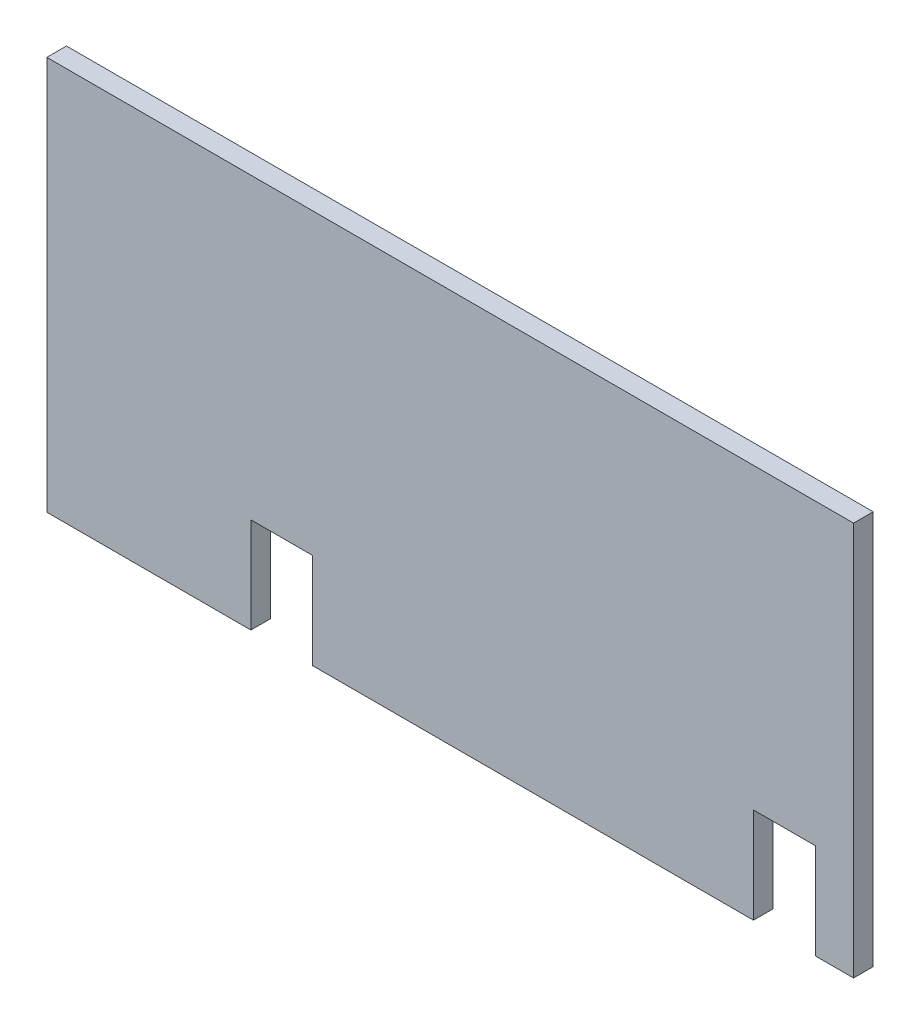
ISO-10303-21;
HEADER;
FILE_DESCRIPTION(('STEP AP214'),'2;1');
FILE_NAME('part.step','',(''),(''),'','','');
FILE_SCHEMA(('AUTOMOTIVE_DESIGN { 1 0 10303 214 1 1 1 1 }'));
ENDSEC;
DATA;
#1=APPLICATION_CONTEXT('core data for automotive mechanical design processes');
#2=APPLICATION_PROTOCOL_DEFINITION('international standard','automotive_design',2000,#1);
#3=PRODUCT_CONTEXT('',#1,'mechanical');
#4=PRODUCT('Part','Part','',(#3));
#5=PRODUCT_RELATED_PRODUCT_CATEGORY('part','',(#4));
#6=PRODUCT_DEFINITION_FORMATION('','',#4);
#7=PRODUCT_DEFINITION_CONTEXT('part definition',#1,'design');
#8=PRODUCT_DEFINITION('design','',#6,#7);
#9=PRODUCT_DEFINITION_SHAPE('','',#8);
#10=(LENGTH_UNIT() NAMED_UNIT(*) SI_UNIT(.MILLI.,.METRE.));
#11=(NAMED_UNIT(*) PLANE_ANGLE_UNIT() SI_UNIT($,.RADIAN.));
#12=(NAMED_UNIT(*) SI_UNIT($,.STERADIAN.) SOLID_ANGLE_UNIT());
#13=UNCERTAINTY_MEASURE_WITH_UNIT(LENGTH_MEASURE(1.E-05),#10,'distance_accuracy_value','');
#14=(GEOMETRIC_REPRESENTATION_CONTEXT(3) GLOBAL_UNCERTAINTY_ASSIGNED_CONTEXT((#13)) GLOBAL_UNIT_ASSIGNED_CONTEXT((#10,
#11,#12)) REPRESENTATION_CONTEXT('',''));
#15=CARTESIAN_POINT('',(0.,0.,0.));
#16=DIRECTION('',(0.,0.,1.));
#17=DIRECTION('',(1.,0.,0.));
#18=AXIS2_PLACEMENT_3D('',#15,#16,#17);
#19=CARTESIAN_POINT('',(-120.396,-17.4250000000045,2.54));
#20=DIRECTION('',(1.,0.,0.));
#21=DIRECTION('',(0.,0.,-1.));
#22=AXIS2_PLACEMENT_3D('',#19,#20,#21);
#23=PLANE('',#22);
#24=DIRECTION('',(0.,-1.,0.));
#25=VECTOR('',#24,1.);
#26=CARTESIAN_POINT('',(-120.396,-17.4250000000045,0.));
#27=LINE('',#26,#25);
#28=CARTESIAN_POINT('',(-120.396,33.5279999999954,0.));
#29=VERTEX_POINT('',#28);
#30=CARTESIAN_POINT('',(-120.396,-17.4250000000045,0.));
#31=VERTEX_POINT('',#30);
#32=EDGE_CURVE('E153',#29,#31,#27,.T.);
#33=ORIENTED_EDGE('',*,*,#32,.T.);
#34=DIRECTION('',(0.,0.,-1.));
#35=VECTOR('',#34,1.);
#36=CARTESIAN_POINT('',(-120.396,-17.4250000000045,2.54));
#37=LINE('',#36,#35);
#38=CARTESIAN_POINT('',(-120.396,-17.4250000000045,2.54));
#39=VERTEX_POINT('',#38);
#40=EDGE_CURVE('E11',#39,#31,#37,.T.);
#41=ORIENTED_EDGE('',*,*,#40,.F.);
#42=DIRECTION('',(0.,-1.,0.));
#43=VECTOR('',#42,1.);
#44=CARTESIAN_POINT('',(-120.396,-17.4250000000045,2.54));
#45=LINE('',#44,#43);
#46=CARTESIAN_POINT('',(-120.396,33.5279999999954,2.54));
#47=VERTEX_POINT('',#46);
#48=EDGE_CURVE('E175',#47,#39,#45,.T.);
#49=ORIENTED_EDGE('',*,*,#48,.F.);
#50=DIRECTION('',(0.,0.,-1.));
#51=VECTOR('',#50,1.);
#52=CARTESIAN_POINT('',(-120.396,33.5279999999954,2.54));
#53=LINE('',#52,#51);
#54=EDGE_CURVE('E149',#47,#29,#53,.T.);
#55=ORIENTED_EDGE('',*,*,#54,.T.);
#56=EDGE_LOOP('',(#33,#41,#49,#55));
#57=FACE_BOUND('',#56,.T.);
#58=ADVANCED_FACE('F33',(#57),#23,.F.);
#59=CARTESIAN_POINT('',(-120.396,-17.4250000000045,2.54));
#60=DIRECTION('',(0.,1.,0.));
#61=DIRECTION('',(-1.,0.,0.));
#62=AXIS2_PLACEMENT_3D('',#59,#60,#61);
#63=PLANE('',#62);
#64=DIRECTION('',(1.,0.,0.));
#65=VECTOR('',#64,1.);
#66=CARTESIAN_POINT('',(-120.396,-17.4250000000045,0.));
#67=LINE('',#66,#65);
#68=CARTESIAN_POINT('',(-94.0000014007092,-17.4250000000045,0.));
#69=VERTEX_POINT('',#68);
#70=EDGE_CURVE('E156',#31,#69,#67,.T.);
#71=ORIENTED_EDGE('',*,*,#70,.T.);
#72=DIRECTION('',(0.,0.,-1.));
#73=VECTOR('',#72,1.);
#74=CARTESIAN_POINT('',(-94.0000014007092,-17.4250000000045,2.54));
#75=LINE('',#74,#73);
#76=CARTESIAN_POINT('',(-94.0000014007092,-17.4250000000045,2.54));
#77=VERTEX_POINT('',#76);
#78=EDGE_CURVE('E41',#77,#69,#75,.T.);
#79=ORIENTED_EDGE('',*,*,#78,.F.);
#80=DIRECTION('',(1.,0.,0.));
#81=VECTOR('',#80,1.);
#82=CARTESIAN_POINT('',(-120.396,-17.4250000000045,2.54));
#83=LINE('',#82,#81);
#84=EDGE_CURVE('E104',#39,#77,#83,.T.);
#85=ORIENTED_EDGE('',*,*,#84,.F.);
#86=ORIENTED_EDGE('',*,*,#40,.T.);
#87=EDGE_LOOP('',(#71,#79,#85,#86));
#88=FACE_BOUND('',#87,.T.);
#89=ADVANCED_FACE('F253',(#88),#63,.F.);
#90=CARTESIAN_POINT('',(-94.0000014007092,-5.08,2.54));
#91=DIRECTION('',(-1.,0.,0.));
#92=DIRECTION('',(0.,0.,1.));
#93=AXIS2_PLACEMENT_3D('',#90,#91,#92);
#94=PLANE('',#93);
#95=DIRECTION('',(0.,1.,0.));
#96=VECTOR('',#95,1.);
#97=CARTESIAN_POINT('',(-94.0000014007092,-5.08,0.));
#98=LINE('',#97,#96);
#99=CARTESIAN_POINT('',(-94.0000014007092,-5.08,0.));
#100=VERTEX_POINT('',#99);
#101=EDGE_CURVE('E158',#69,#100,#98,.T.);
#102=ORIENTED_EDGE('',*,*,#101,.T.);
#103=DIRECTION('',(0.,0.,-1.));
#104=VECTOR('',#103,1.);
#105=CARTESIAN_POINT('',(-94.0000014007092,-5.08,2.54));
#106=LINE('',#105,#104);
#107=CARTESIAN_POINT('',(-94.0000014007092,-5.08,2.54));
#108=VERTEX_POINT('',#107);
#109=EDGE_CURVE('E194',#108,#100,#106,.T.);
#110=ORIENTED_EDGE('',*,*,#109,.F.);
#111=DIRECTION('',(0.,1.,0.));
#112=VECTOR('',#111,1.);
#113=CARTESIAN_POINT('',(-94.0000014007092,-5.08,2.54));
#114=LINE('',#113,#112);
#115=EDGE_CURVE('E202',#77,#108,#114,.T.);
#116=ORIENTED_EDGE('',*,*,#115,.F.);
#117=ORIENTED_EDGE('',*,*,#78,.T.);
#118=EDGE_LOOP('',(#102,#110,#116,#117));
#119=FACE_BOUND('',#118,.T.);
#120=ADVANCED_FACE('F200',(#119),#94,.F.);
#121=CARTESIAN_POINT('',(-94.0000014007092,-5.08,2.54));
#122=DIRECTION('',(0.,1.,0.));
#123=DIRECTION('',(0.,0.,1.));
#124=AXIS2_PLACEMENT_3D('',#121,#122,#123);
#125=PLANE('',#124);
#126=DIRECTION('',(1.,0.,0.));
#127=VECTOR('',#126,1.);
#128=CARTESIAN_POINT('',(-94.0000014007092,-5.08,0.));
#129=LINE('',#128,#127);
#130=CARTESIAN_POINT('',(-86.0000012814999,-5.08,0.));
#131=VERTEX_POINT('',#130);
#132=EDGE_CURVE('E160',#100,#131,#129,.T.);
#133=ORIENTED_EDGE('',*,*,#132,.T.);
#134=DIRECTION('',(0.,0.,-1.));
#135=VECTOR('',#134,1.);
#136=CARTESIAN_POINT('',(-86.0000012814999,-5.08,2.54));
#137=LINE('',#136,#135);
#138=CARTESIAN_POINT('',(-86.0000012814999,-5.08,2.54));
#139=VERTEX_POINT('',#138);
#140=EDGE_CURVE('E191',#139,#131,#137,.T.);
#141=ORIENTED_EDGE('',*,*,#140,.F.);
#142=DIRECTION('',(1.,0.,0.));
#143=VECTOR('',#142,1.);
#144=CARTESIAN_POINT('',(-94.0000014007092,-5.08,2.54));
#145=LINE('',#144,#143);
#146=EDGE_CURVE('E220',#108,#139,#145,.T.);
#147=ORIENTED_EDGE('',*,*,#146,.F.);
#148=ORIENTED_EDGE('',*,*,#109,.T.);
#149=EDGE_LOOP('',(#133,#141,#147,#148));
#150=FACE_BOUND('',#149,.T.);
#151=ADVANCED_FACE('F211',(#150),#125,.F.);
#152=CARTESIAN_POINT('',(-86.0000012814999,-5.08,2.54));
#153=DIRECTION('',(1.,0.,0.));
#154=DIRECTION('',(0.,0.,-1.));
#155=AXIS2_PLACEMENT_3D('',#152,#153,#154);
#156=PLANE('',#155);
#157=DIRECTION('',(0.,-1.,0.));
#158=VECTOR('',#157,1.);
#159=CARTESIAN_POINT('',(-86.0000012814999,-5.08,0.));
#160=LINE('',#159,#158);
#161=CARTESIAN_POINT('',(-86.0000012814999,-17.4250000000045,0.));
#162=VERTEX_POINT('',#161);
#163=EDGE_CURVE('E162',#131,#162,#160,.T.);
#164=ORIENTED_EDGE('',*,*,#163,.T.);
#165=DIRECTION('',(0.,0.,-1.));
#166=VECTOR('',#165,1.);
#167=CARTESIAN_POINT('',(-86.0000012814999,-17.4250000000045,2.54));
#168=LINE('',#167,#166);
#169=CARTESIAN_POINT('',(-86.0000012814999,-17.4250000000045,2.54));
#170=VERTEX_POINT('',#169);
#171=EDGE_CURVE('E188',#170,#162,#168,.T.);
#172=ORIENTED_EDGE('',*,*,#171,.F.);
#173=DIRECTION('',(0.,-1.,0.));
#174=VECTOR('',#173,1.);
#175=CARTESIAN_POINT('',(-86.0000012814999,-5.08,2.54));
#176=LINE('',#175,#174);
#177=EDGE_CURVE('E217',#139,#170,#176,.T.);
#178=ORIENTED_EDGE('',*,*,#177,.F.);
#179=ORIENTED_EDGE('',*,*,#140,.T.);
#180=EDGE_LOOP('',(#164,#172,#178,#179));
#181=FACE_BOUND('',#180,.T.);
#182=ADVANCED_FACE('F215',(#181),#156,.F.);
#183=CARTESIAN_POINT('',(-86.0000012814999,-17.4250000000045,2.54));
#184=DIRECTION('',(0.,1.,0.));
#185=DIRECTION('',(-1.,0.,0.));
#186=AXIS2_PLACEMENT_3D('',#183,#184,#185);
#187=PLANE('',#186);
#188=DIRECTION('',(1.,0.,0.));
#189=VECTOR('',#188,1.);
#190=CARTESIAN_POINT('',(-86.0000012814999,-17.4250000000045,0.));
#191=LINE('',#190,#189);
#192=CARTESIAN_POINT('',(-29.0000004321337,-17.4250000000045,0.));
#193=VERTEX_POINT('',#192);
#194=EDGE_CURVE('E164',#162,#193,#191,.T.);
#195=ORIENTED_EDGE('',*,*,#194,.T.);
#196=DIRECTION('',(0.,0.,-1.));
#197=VECTOR('',#196,1.);
#198=CARTESIAN_POINT('',(-29.0000004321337,-17.4250000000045,2.54));
#199=LINE('',#198,#197);
#200=CARTESIAN_POINT('',(-29.0000004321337,-17.4250000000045,2.54));
#201=VERTEX_POINT('',#200);
#202=EDGE_CURVE('E185',#201,#193,#199,.T.);
#203=ORIENTED_EDGE('',*,*,#202,.F.);
#204=DIRECTION('',(1.,0.,0.));
#205=VECTOR('',#204,1.);
#206=CARTESIAN_POINT('',(-86.0000012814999,-17.4250000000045,2.54));
#207=LINE('',#206,#205);
#208=EDGE_CURVE('E219',#170,#201,#207,.T.);
#209=ORIENTED_EDGE('',*,*,#208,.F.);
#210=ORIENTED_EDGE('',*,*,#171,.T.);
#211=EDGE_LOOP('',(#195,#203,#209,#210));
#212=FACE_BOUND('',#211,.T.);
#213=ADVANCED_FACE('F266',(#212),#187,.F.);
#214=CARTESIAN_POINT('',(-29.0000004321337,-5.08,2.54));
#215=DIRECTION('',(-1.,0.,0.));
#216=DIRECTION('',(0.,0.,1.));
#217=AXIS2_PLACEMENT_3D('',#214,#215,#216);
#218=PLANE('',#217);
#219=DIRECTION('',(0.,1.,0.));
#220=VECTOR('',#219,1.);
#221=CARTESIAN_POINT('',(-29.0000004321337,-5.08,0.));
#222=LINE('',#221,#220);
#223=CARTESIAN_POINT('',(-29.0000004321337,-5.08,0.));
#224=VERTEX_POINT('',#223);
#225=EDGE_CURVE('E166',#193,#224,#222,.T.);
#226=ORIENTED_EDGE('',*,*,#225,.T.);
#227=DIRECTION('',(0.,0.,-1.));
#228=VECTOR('',#227,1.);
#229=CARTESIAN_POINT('',(-29.0000004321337,-5.08,2.54));
#230=LINE('',#229,#228);
#231=CARTESIAN_POINT('',(-29.0000004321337,-5.08,2.54));
#232=VERTEX_POINT('',#231);
#233=EDGE_CURVE('E182',#232,#224,#230,.T.);
#234=ORIENTED_EDGE('',*,*,#233,.F.);
#235=DIRECTION('',(0.,1.,0.));
#236=VECTOR('',#235,1.);
#237=CARTESIAN_POINT('',(-29.0000004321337,-5.08,2.54));
#238=LINE('',#237,#236);
#239=EDGE_CURVE('E222',#201,#232,#238,.T.);
#240=ORIENTED_EDGE('',*,*,#239,.F.);
#241=ORIENTED_EDGE('',*,*,#202,.T.);
#242=EDGE_LOOP('',(#226,#234,#240,#241));
#243=FACE_BOUND('',#242,.T.);
#244=ADVANCED_FACE('F269',(#243),#218,.F.);
#245=CARTESIAN_POINT('',(-29.0000004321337,-5.08,2.54));
#246=DIRECTION('',(0.,1.,0.));
#247=DIRECTION('',(0.,0.,1.));
#248=AXIS2_PLACEMENT_3D('',#245,#246,#247);
#249=PLANE('',#248);
#250=DIRECTION('',(1.,0.,0.));
#251=VECTOR('',#250,1.);
#252=CARTESIAN_POINT('',(-29.0000004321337,-5.08,0.));
#253=LINE('',#252,#251);
#254=CARTESIAN_POINT('',(-21.0000003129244,-5.08,0.));
#255=VERTEX_POINT('',#254);
#256=EDGE_CURVE('E168',#224,#255,#253,.T.);
#257=ORIENTED_EDGE('',*,*,#256,.T.);
#258=DIRECTION('',(0.,0.,-1.));
#259=VECTOR('',#258,1.);
#260=CARTESIAN_POINT('',(-21.0000003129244,-5.08,2.54));
#261=LINE('',#260,#259);
#262=CARTESIAN_POINT('',(-21.0000003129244,-5.08,2.54));
#263=VERTEX_POINT('',#262);
#264=EDGE_CURVE('E179',#263,#255,#261,.T.);
#265=ORIENTED_EDGE('',*,*,#264,.F.);
#266=DIRECTION('',(1.,0.,0.));
#267=VECTOR('',#266,1.);
#268=CARTESIAN_POINT('',(-29.0000004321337,-5.08,2.54));
#269=LINE('',#268,#267);
#270=EDGE_CURVE('E228',#232,#263,#269,.T.);
#271=ORIENTED_EDGE('',*,*,#270,.F.);
#272=ORIENTED_EDGE('',*,*,#233,.T.);
#273=EDGE_LOOP('',(#257,#265,#271,#272));
#274=FACE_BOUND('',#273,.T.);
#275=ADVANCED_FACE('F234',(#274),#249,.F.);
#276=CARTESIAN_POINT('',(-21.0000003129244,-5.08,2.54));
#277=DIRECTION('',(1.,0.,0.));
#278=DIRECTION('',(0.,0.,-1.));
#279=AXIS2_PLACEMENT_3D('',#276,#277,#278);
#280=PLANE('',#279);
#281=DIRECTION('',(0.,-1.,0.));
#282=VECTOR('',#281,1.);
#283=CARTESIAN_POINT('',(-21.0000003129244,-5.08,0.));
#284=LINE('',#283,#282);
#285=CARTESIAN_POINT('',(-21.0000003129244,-17.4250000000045,0.));
#286=VERTEX_POINT('',#285);
#287=EDGE_CURVE('E170',#255,#286,#284,.T.);
#288=ORIENTED_EDGE('',*,*,#287,.T.);
#289=DIRECTION('',(0.,0.,-1.));
#290=VECTOR('',#289,1.);
#291=CARTESIAN_POINT('',(-21.0000003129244,-17.4250000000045,2.54));
#292=LINE('',#291,#290);
#293=CARTESIAN_POINT('',(-21.0000003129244,-17.4250000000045,2.54));
#294=VERTEX_POINT('',#293);
#295=EDGE_CURVE('E144',#294,#286,#292,.T.);
#296=ORIENTED_EDGE('',*,*,#295,.F.);
#297=DIRECTION('',(0.,-1.,0.));
#298=VECTOR('',#297,1.);
#299=CARTESIAN_POINT('',(-21.0000003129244,-5.08,2.54));
#300=LINE('',#299,#298);
#301=EDGE_CURVE('E135',#263,#294,#300,.T.);
#302=ORIENTED_EDGE('',*,*,#301,.F.);
#303=ORIENTED_EDGE('',*,*,#264,.T.);
#304=EDGE_LOOP('',(#288,#296,#302,#303));
#305=FACE_BOUND('',#304,.T.);
#306=ADVANCED_FACE('F238',(#305),#280,.F.);
#307=CARTESIAN_POINT('',(-21.0000003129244,-17.4250000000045,2.54));
#308=DIRECTION('',(0.,1.,0.));
#309=DIRECTION('',(0.,0.,1.));
#310=AXIS2_PLACEMENT_3D('',#307,#308,#309);
#311=PLANE('',#310);
#312=DIRECTION('',(1.,0.,0.));
#313=VECTOR('',#312,1.);
#314=CARTESIAN_POINT('',(-21.0000003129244,-17.4250000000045,0.));
#315=LINE('',#314,#313);
#316=CARTESIAN_POINT('',(-16.0499999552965,-17.4250000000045,0.));
#317=VERTEX_POINT('',#316);
#318=EDGE_CURVE('E143',#286,#317,#315,.T.);
#319=ORIENTED_EDGE('',*,*,#318,.T.);
#320=DIRECTION('',(0.,0.,-1.));
#321=VECTOR('',#320,1.);
#322=CARTESIAN_POINT('',(-16.0499999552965,-17.4250000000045,2.54));
#323=LINE('',#322,#321);
#324=CARTESIAN_POINT('',(-16.0499999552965,-17.4250000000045,2.54));
#325=VERTEX_POINT('',#324);
#326=EDGE_CURVE('E140',#325,#317,#323,.T.);
#327=ORIENTED_EDGE('',*,*,#326,.F.);
#328=DIRECTION('',(1.,0.,0.));
#329=VECTOR('',#328,1.);
#330=CARTESIAN_POINT('',(-21.0000003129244,-17.4250000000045,2.54));
#331=LINE('',#330,#329);
#332=EDGE_CURVE('E129',#294,#325,#331,.T.);
#333=ORIENTED_EDGE('',*,*,#332,.F.);
#334=ORIENTED_EDGE('',*,*,#295,.T.);
#335=EDGE_LOOP('',(#319,#327,#333,#334));
#336=FACE_BOUND('',#335,.T.);
#337=ADVANCED_FACE('F141',(#336),#311,.F.);
#338=CARTESIAN_POINT('',(-16.0499999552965,-17.4250000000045,2.54));
#339=DIRECTION('',(-1.,0.,0.));
#340=DIRECTION('',(0.,0.,1.));
#341=AXIS2_PLACEMENT_3D('',#338,#339,#340);
#342=PLANE('',#341);
#343=DIRECTION('',(0.,1.,0.));
#344=VECTOR('',#343,1.);
#345=CARTESIAN_POINT('',(-16.0499999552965,-17.4250000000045,0.));
#346=LINE('',#345,#344);
#347=CARTESIAN_POINT('',(-16.0499999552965,33.5279999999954,0.));
#348=VERTEX_POINT('',#347);
#349=EDGE_CURVE('E90',#317,#348,#346,.T.);
#350=ORIENTED_EDGE('',*,*,#349,.T.);
#351=DIRECTION('',(0.,0.,-1.));
#352=VECTOR('',#351,1.);
#353=CARTESIAN_POINT('',(-16.0499999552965,33.5279999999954,2.54));
#354=LINE('',#353,#352);
#355=CARTESIAN_POINT('',(-16.0499999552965,33.5279999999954,2.54));
#356=VERTEX_POINT('',#355);
#357=EDGE_CURVE('E145',#356,#348,#354,.T.);
#358=ORIENTED_EDGE('',*,*,#357,.F.);
#359=DIRECTION('',(0.,1.,0.));
#360=VECTOR('',#359,1.);
#361=CARTESIAN_POINT('',(-16.0499999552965,-17.4250000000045,2.54));
#362=LINE('',#361,#360);
#363=EDGE_CURVE('E133',#325,#356,#362,.T.);
#364=ORIENTED_EDGE('',*,*,#363,.F.);
#365=ORIENTED_EDGE('',*,*,#326,.T.);
#366=EDGE_LOOP('',(#350,#358,#364,#365));
#367=FACE_BOUND('',#366,.T.);
#368=ADVANCED_FACE('F147',(#367),#342,.F.);
#369=CARTESIAN_POINT('',(-120.396,33.5279999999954,2.54));
#370=DIRECTION('',(0.,-1.,0.));
#371=DIRECTION('',(0.,0.,-1.));
#372=AXIS2_PLACEMENT_3D('',#369,#370,#371);
#373=PLANE('',#372);
#374=DIRECTION('',(-1.,0.,0.));
#375=VECTOR('',#374,1.);
#376=CARTESIAN_POINT('',(-120.396,33.5279999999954,0.));
#377=LINE('',#376,#375);
#378=EDGE_CURVE('E96',#348,#29,#377,.T.);
#379=ORIENTED_EDGE('',*,*,#378,.T.);
#380=ORIENTED_EDGE('',*,*,#54,.F.);
#381=DIRECTION('',(-1.,0.,0.));
#382=VECTOR('',#381,1.);
#383=CARTESIAN_POINT('',(-120.396,33.5279999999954,2.54));
#384=LINE('',#383,#382);
#385=EDGE_CURVE('E49',#356,#47,#384,.T.);
#386=ORIENTED_EDGE('',*,*,#385,.F.);
#387=ORIENTED_EDGE('',*,*,#357,.T.);
#388=EDGE_LOOP('',(#379,#380,#386,#387));
#389=FACE_BOUND('',#388,.T.);
#390=ADVANCED_FACE('F242',(#389),#373,.F.);
#391=CARTESIAN_POINT('',(0.,0.,2.54));
#392=DIRECTION('',(0.,0.,-1.));
#393=DIRECTION('',(-1.,0.,0.));
#394=AXIS2_PLACEMENT_3D('',#391,#392,#393);
#395=PLANE('',#394);
#396=ORIENTED_EDGE('',*,*,#48,.T.);
#397=ORIENTED_EDGE('',*,*,#84,.T.);
#398=ORIENTED_EDGE('',*,*,#115,.T.);
#399=ORIENTED_EDGE('',*,*,#146,.T.);
#400=ORIENTED_EDGE('',*,*,#177,.T.);
#401=ORIENTED_EDGE('',*,*,#208,.T.);
#402=ORIENTED_EDGE('',*,*,#239,.T.);
#403=ORIENTED_EDGE('',*,*,#270,.T.);
#404=ORIENTED_EDGE('',*,*,#301,.T.);
#405=ORIENTED_EDGE('',*,*,#332,.T.);
#406=ORIENTED_EDGE('',*,*,#363,.T.);
#407=ORIENTED_EDGE('',*,*,#385,.T.);
#408=EDGE_LOOP('',(#396,#397,#398,#399,#400,#401,#402,#403,#404,#405,#406,#407));
#409=FACE_BOUND('',#408,.T.);
#410=ADVANCED_FACE('F131',(#409),#395,.F.);
#411=CARTESIAN_POINT('',(0.,0.,0.));
#412=DIRECTION('',(0.,0.,-1.));
#413=DIRECTION('',(-1.,0.,0.));
#414=AXIS2_PLACEMENT_3D('',#411,#412,#413);
#415=PLANE('',#414);
#416=ORIENTED_EDGE('',*,*,#32,.F.);
#417=ORIENTED_EDGE('',*,*,#378,.F.);
#418=ORIENTED_EDGE('',*,*,#349,.F.);
#419=ORIENTED_EDGE('',*,*,#318,.F.);
#420=ORIENTED_EDGE('',*,*,#287,.F.);
#421=ORIENTED_EDGE('',*,*,#256,.F.);
#422=ORIENTED_EDGE('',*,*,#225,.F.);
#423=ORIENTED_EDGE('',*,*,#194,.F.);
#424=ORIENTED_EDGE('',*,*,#163,.F.);
#425=ORIENTED_EDGE('',*,*,#132,.F.);
#426=ORIENTED_EDGE('',*,*,#101,.F.);
#427=ORIENTED_EDGE('',*,*,#70,.F.);
#428=EDGE_LOOP('',(#416,#417,#418,#419,#420,#421,#422,#423,#424,#425,#426,#427));
#429=FACE_BOUND('',#428,.T.);
#430=ADVANCED_FACE('F206',(#429),#415,.T.);
#431=CLOSED_SHELL('',(#58,#89,#120,#151,#182,#213,#244,#275,#306,#337,#368,#390,#410,#430));
#432=MANIFOLD_SOLID_BREP('B2',#431);
#433=ADVANCED_BREP_SHAPE_REPRESENTATION('',(#18,#432),#14);
#434=SHAPE_DEFINITION_REPRESENTATION(#9,#433);
ENDSEC;
END-ISO-10303-21;
